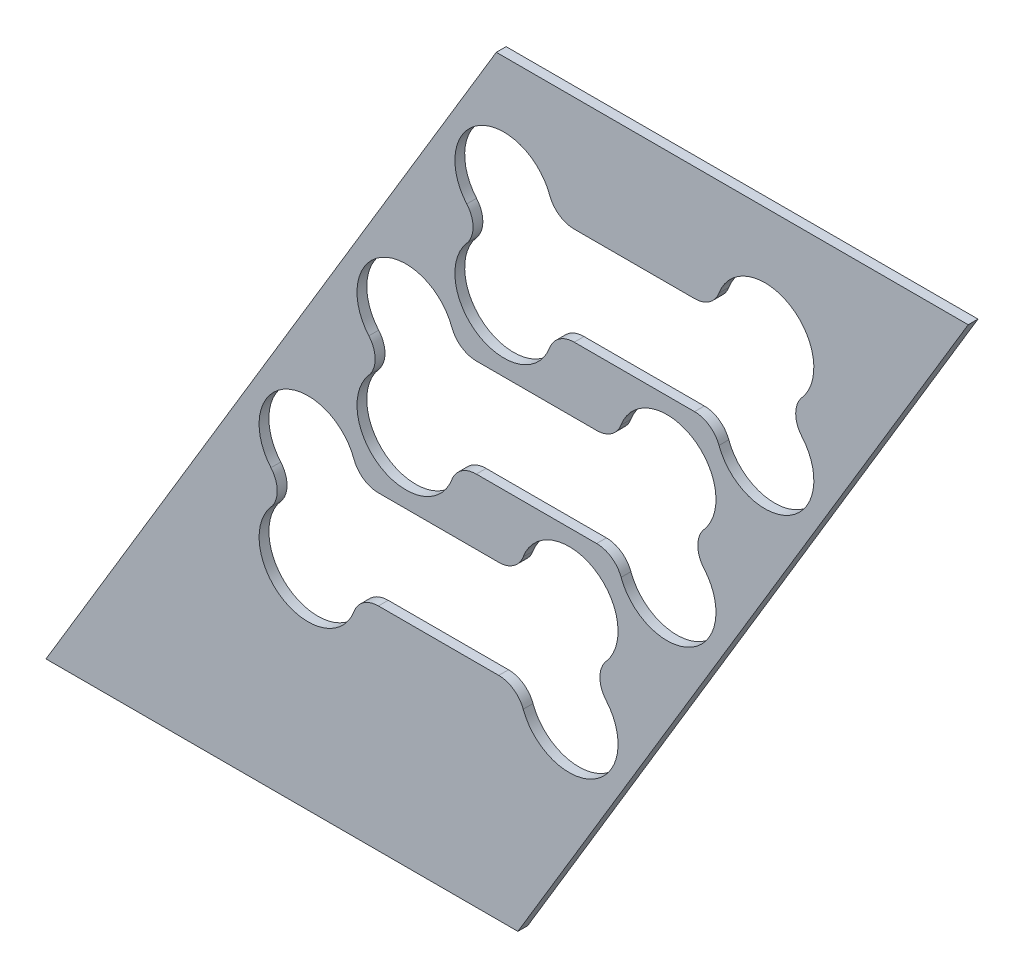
ISO-10303-21;
HEADER;
FILE_DESCRIPTION(('STEP AP214'),'2;1');
FILE_NAME('part.step','',(''),(''),'','','');
FILE_SCHEMA(('AUTOMOTIVE_DESIGN { 1 0 10303 214 1 1 1 1 }'));
ENDSEC;
DATA;
#1=APPLICATION_CONTEXT('core data for automotive mechanical design processes');
#2=APPLICATION_PROTOCOL_DEFINITION('international standard','automotive_design',2000,#1);
#3=PRODUCT_CONTEXT('',#1,'mechanical');
#4=PRODUCT('Part','Part','',(#3));
#5=PRODUCT_RELATED_PRODUCT_CATEGORY('part','',(#4));
#6=PRODUCT_DEFINITION_FORMATION('','',#4);
#7=PRODUCT_DEFINITION_CONTEXT('part definition',#1,'design');
#8=PRODUCT_DEFINITION('design','',#6,#7);
#9=PRODUCT_DEFINITION_SHAPE('','',#8);
#10=(LENGTH_UNIT() NAMED_UNIT(*) SI_UNIT(.MILLI.,.METRE.));
#11=(NAMED_UNIT(*) PLANE_ANGLE_UNIT() SI_UNIT($,.RADIAN.));
#12=(NAMED_UNIT(*) SI_UNIT($,.STERADIAN.) SOLID_ANGLE_UNIT());
#13=UNCERTAINTY_MEASURE_WITH_UNIT(LENGTH_MEASURE(1.E-05),#10,'distance_accuracy_value','');
#14=(GEOMETRIC_REPRESENTATION_CONTEXT(3) GLOBAL_UNCERTAINTY_ASSIGNED_CONTEXT((#13)) GLOBAL_UNIT_ASSIGNED_CONTEXT((#10,
#11,#12)) REPRESENTATION_CONTEXT('',''));
#15=CARTESIAN_POINT('',(0.,0.,0.));
#16=DIRECTION('',(0.,0.,1.));
#17=DIRECTION('',(1.,0.,0.));
#18=AXIS2_PLACEMENT_3D('',#15,#16,#17);
#19=CARTESIAN_POINT('',(81.1519017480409,75.,1.5));
#20=DIRECTION('',(0.,0.,-1.));
#21=DIRECTION('',(-1.,0.,0.));
#22=AXIS2_PLACEMENT_3D('',#19,#20,#21);
#23=PLANE('',#22);
#24=CARTESIAN_POINT('',(24.2180706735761,36.5,1.5));
#25=DIRECTION('',(0.,0.,-1.));
#26=DIRECTION('',(1.,0.,0.));
#27=AXIS2_PLACEMENT_3D('',#24,#25,#26);
#28=CIRCLE('',#27,3.99999999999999);
#29=CARTESIAN_POINT('',(27.9683069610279,35.1086956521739,1.5));
#30=VERTEX_POINT('',#29);
#31=CARTESIAN_POINT('',(24.2180706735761,32.5,1.5));
#32=VERTEX_POINT('',#31);
#33=EDGE_CURVE('E387',#30,#32,#28,.T.);
#34=ORIENTED_EDGE('',*,*,#33,.F.);
#35=CARTESIAN_POINT('',(35.,32.5,1.5));
#36=DIRECTION('',(0.,0.,1.));
#37=DIRECTION('',(1.,0.,0.));
#38=AXIS2_PLACEMENT_3D('',#35,#36,#37);
#39=CIRCLE('',#38,7.5);
#40=CARTESIAN_POINT('',(40.68552036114,27.6086956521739,1.5));
#41=VERTEX_POINT('',#40);
#42=EDGE_CURVE('E411',#41,#30,#39,.T.);
#43=ORIENTED_EDGE('',*,*,#42,.F.);
#44=CARTESIAN_POINT('',(43.7177978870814,25.,1.5));
#45=DIRECTION('',(0.,0.,-1.));
#46=DIRECTION('',(1.,0.,0.));
#47=AXIS2_PLACEMENT_3D('',#44,#45,#46);
#48=CIRCLE('',#47,4.);
#49=CARTESIAN_POINT('',(40.68552036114,22.3913043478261,1.5));
#50=VERTEX_POINT('',#49);
#51=EDGE_CURVE('E408',#50,#41,#48,.T.);
#52=ORIENTED_EDGE('',*,*,#51,.F.);
#53=CARTESIAN_POINT('',(35.,17.5,1.5));
#54=DIRECTION('',(0.,0.,1.));
#55=DIRECTION('',(1.,0.,0.));
#56=AXIS2_PLACEMENT_3D('',#53,#54,#55);
#57=CIRCLE('',#56,7.5);
#58=CARTESIAN_POINT('',(27.9683069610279,14.8913043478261,1.5));
#59=VERTEX_POINT('',#58);
#60=EDGE_CURVE('E406',#59,#50,#57,.T.);
#61=ORIENTED_EDGE('',*,*,#60,.F.);
#62=CARTESIAN_POINT('',(24.2180706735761,13.5,1.5));
#63=DIRECTION('',(0.,0.,-1.));
#64=DIRECTION('',(1.,0.,0.));
#65=AXIS2_PLACEMENT_3D('',#62,#63,#64);
#66=CIRCLE('',#65,4.);
#67=CARTESIAN_POINT('',(24.2180706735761,17.5,1.5));
#68=VERTEX_POINT('',#67);
#69=EDGE_CURVE('E404',#68,#59,#66,.T.);
#70=ORIENTED_EDGE('',*,*,#69,.F.);
#71=DIRECTION('',(1.,0.,0.));
#72=VECTOR('',#71,1.);
#73=CARTESIAN_POINT('',(5.78192932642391,17.5,1.5));
#74=LINE('',#73,#72);
#75=CARTESIAN_POINT('',(5.78192932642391,17.5,1.5));
#76=VERTEX_POINT('',#75);
#77=EDGE_CURVE('E402',#76,#68,#74,.T.);
#78=ORIENTED_EDGE('',*,*,#77,.F.);
#79=CARTESIAN_POINT('',(5.78192932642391,13.5,1.5));
#80=DIRECTION('',(0.,0.,-1.));
#81=DIRECTION('',(1.,0.,0.));
#82=AXIS2_PLACEMENT_3D('',#79,#80,#81);
#83=CIRCLE('',#82,4.);
#84=CARTESIAN_POINT('',(2.03169303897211,14.8913043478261,1.5));
#85=VERTEX_POINT('',#84);
#86=EDGE_CURVE('E400',#85,#76,#83,.T.);
#87=ORIENTED_EDGE('',*,*,#86,.F.);
#88=CARTESIAN_POINT('',(-5.,17.5,1.5));
#89=DIRECTION('',(0.,0.,1.));
#90=DIRECTION('',(1.,0.,0.));
#91=AXIS2_PLACEMENT_3D('',#88,#89,#90);
#92=CIRCLE('',#91,7.5);
#93=CARTESIAN_POINT('',(-10.68552036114,22.3913043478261,1.5));
#94=VERTEX_POINT('',#93);
#95=EDGE_CURVE('E398',#94,#85,#92,.T.);
#96=ORIENTED_EDGE('',*,*,#95,.F.);
#97=CARTESIAN_POINT('',(-13.7177978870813,25.,1.5));
#98=DIRECTION('',(0.,0.,-1.));
#99=DIRECTION('',(1.,0.,0.));
#100=AXIS2_PLACEMENT_3D('',#97,#98,#99);
#101=CIRCLE('',#100,4.);
#102=CARTESIAN_POINT('',(-10.68552036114,27.6086956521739,1.5));
#103=VERTEX_POINT('',#102);
#104=EDGE_CURVE('E396',#103,#94,#101,.T.);
#105=ORIENTED_EDGE('',*,*,#104,.F.);
#106=CARTESIAN_POINT('',(-5.,32.5,1.5));
#107=DIRECTION('',(0.,0.,1.));
#108=DIRECTION('',(1.,0.,0.));
#109=AXIS2_PLACEMENT_3D('',#106,#107,#108);
#110=CIRCLE('',#109,7.5);
#111=CARTESIAN_POINT('',(2.03169303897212,35.1086956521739,1.5));
#112=VERTEX_POINT('',#111);
#113=EDGE_CURVE('E394',#112,#103,#110,.T.);
#114=ORIENTED_EDGE('',*,*,#113,.F.);
#115=CARTESIAN_POINT('',(5.78192932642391,36.5,1.5));
#116=DIRECTION('',(0.,0.,-1.));
#117=DIRECTION('',(1.,0.,0.));
#118=AXIS2_PLACEMENT_3D('',#115,#116,#117);
#119=CIRCLE('',#118,4.);
#120=CARTESIAN_POINT('',(5.78192932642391,32.5,1.5));
#121=VERTEX_POINT('',#120);
#122=EDGE_CURVE('E392',#121,#112,#119,.T.);
#123=ORIENTED_EDGE('',*,*,#122,.F.);
#124=DIRECTION('',(-1.,0.,0.));
#125=VECTOR('',#124,1.);
#126=CARTESIAN_POINT('',(24.2180706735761,32.5,1.5));
#127=LINE('',#126,#125);
#128=EDGE_CURVE('E389',#32,#121,#127,.T.);
#129=ORIENTED_EDGE('',*,*,#128,.F.);
#130=EDGE_LOOP('',(#34,#43,#52,#61,#70,#78,#87,#96,#105,#114,#123,#129));
#131=FACE_BOUND('',#130,.T.);
#132=DIRECTION('',(-1.,0.,0.));
#133=VECTOR('',#132,1.);
#134=CARTESIAN_POINT('',(8.84809825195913,75.,1.5));
#135=LINE('',#134,#133);
#136=CARTESIAN_POINT('',(81.1519017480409,75.,1.5));
#137=VERTEX_POINT('',#136);
#138=CARTESIAN_POINT('',(8.84809825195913,75.,1.5));
#139=VERTEX_POINT('',#138);
#140=EDGE_CURVE('E561',#137,#139,#135,.T.);
#141=ORIENTED_EDGE('',*,*,#140,.T.);
#142=DIRECTION('',(-0.514495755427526,-0.857492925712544,0.));
#143=VECTOR('',#142,1.);
#144=CARTESIAN_POINT('',(8.84809825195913,75.,1.5));
#145=LINE('',#144,#143);
#146=CARTESIAN_POINT('',(-60.1519017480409,-40.,1.5));
#147=VERTEX_POINT('',#146);
#148=EDGE_CURVE('E564',#139,#147,#145,.T.);
#149=ORIENTED_EDGE('',*,*,#148,.T.);
#150=DIRECTION('',(1.,0.,0.));
#151=VECTOR('',#150,1.);
#152=CARTESIAN_POINT('',(-60.1519017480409,-40.,1.5));
#153=LINE('',#152,#151);
#154=CARTESIAN_POINT('',(12.1519017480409,-40.,1.5));
#155=VERTEX_POINT('',#154);
#156=EDGE_CURVE('E567',#147,#155,#153,.T.);
#157=ORIENTED_EDGE('',*,*,#156,.T.);
#158=DIRECTION('',(0.514495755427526,0.857492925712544,0.));
#159=VECTOR('',#158,1.);
#160=CARTESIAN_POINT('',(81.1519017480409,75.,1.5));
#161=LINE('',#160,#159);
#162=EDGE_CURVE('E569',#155,#137,#161,.T.);
#163=ORIENTED_EDGE('',*,*,#162,.T.);
#164=EDGE_LOOP('',(#141,#149,#157,#163));
#165=FACE_BOUND('',#164,.T.);
#166=CARTESIAN_POINT('',(9.2180706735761,11.5,1.5));
#167=DIRECTION('',(0.,0.,-1.));
#168=DIRECTION('',(1.,0.,0.));
#169=AXIS2_PLACEMENT_3D('',#166,#167,#168);
#170=CIRCLE('',#169,4.);
#171=CARTESIAN_POINT('',(12.9683069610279,10.1086956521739,1.5));
#172=VERTEX_POINT('',#171);
#173=CARTESIAN_POINT('',(9.2180706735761,7.50000000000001,1.5));
#174=VERTEX_POINT('',#173);
#175=EDGE_CURVE('E474',#172,#174,#170,.T.);
#176=ORIENTED_EDGE('',*,*,#175,.F.);
#177=CARTESIAN_POINT('',(20.,7.50000000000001,1.5));
#178=DIRECTION('',(0.,0.,1.));
#179=DIRECTION('',(1.,0.,0.));
#180=AXIS2_PLACEMENT_3D('',#177,#178,#179);
#181=CIRCLE('',#180,7.5);
#182=CARTESIAN_POINT('',(25.68552036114,2.60869565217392,1.5));
#183=VERTEX_POINT('',#182);
#184=EDGE_CURVE('E498',#183,#172,#181,.T.);
#185=ORIENTED_EDGE('',*,*,#184,.F.);
#186=CARTESIAN_POINT('',(28.7177978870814,0.,1.5));
#187=DIRECTION('',(0.,0.,-1.));
#188=DIRECTION('',(1.,0.,0.));
#189=AXIS2_PLACEMENT_3D('',#186,#187,#188);
#190=CIRCLE('',#189,4.);
#191=CARTESIAN_POINT('',(25.68552036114,-2.60869565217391,1.5));
#192=VERTEX_POINT('',#191);
#193=EDGE_CURVE('E495',#192,#183,#190,.T.);
#194=ORIENTED_EDGE('',*,*,#193,.F.);
#195=CARTESIAN_POINT('',(20.,-7.49999999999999,1.5));
#196=DIRECTION('',(0.,0.,1.));
#197=DIRECTION('',(1.,0.,0.));
#198=AXIS2_PLACEMENT_3D('',#195,#196,#197);
#199=CIRCLE('',#198,7.5);
#200=CARTESIAN_POINT('',(12.9683069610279,-10.1086956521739,1.5));
#201=VERTEX_POINT('',#200);
#202=EDGE_CURVE('E493',#201,#192,#199,.T.);
#203=ORIENTED_EDGE('',*,*,#202,.F.);
#204=CARTESIAN_POINT('',(9.2180706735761,-11.5,1.5));
#205=DIRECTION('',(0.,0.,-1.));
#206=DIRECTION('',(1.,0.,0.));
#207=AXIS2_PLACEMENT_3D('',#204,#205,#206);
#208=CIRCLE('',#207,4.);
#209=CARTESIAN_POINT('',(9.2180706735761,-7.5,1.5));
#210=VERTEX_POINT('',#209);
#211=EDGE_CURVE('E491',#210,#201,#208,.T.);
#212=ORIENTED_EDGE('',*,*,#211,.F.);
#213=DIRECTION('',(1.,0.,0.));
#214=VECTOR('',#213,1.);
#215=CARTESIAN_POINT('',(-9.21807067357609,-7.5,1.5));
#216=LINE('',#215,#214);
#217=CARTESIAN_POINT('',(-9.21807067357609,-7.5,1.5));
#218=VERTEX_POINT('',#217);
#219=EDGE_CURVE('E489',#218,#210,#216,.T.);
#220=ORIENTED_EDGE('',*,*,#219,.F.);
#221=CARTESIAN_POINT('',(-9.21807067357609,-11.5,1.5));
#222=DIRECTION('',(0.,0.,-1.));
#223=DIRECTION('',(1.,0.,0.));
#224=AXIS2_PLACEMENT_3D('',#221,#222,#223);
#225=CIRCLE('',#224,4.);
#226=CARTESIAN_POINT('',(-12.9683069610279,-10.1086956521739,1.5));
#227=VERTEX_POINT('',#226);
#228=EDGE_CURVE('E487',#227,#218,#225,.T.);
#229=ORIENTED_EDGE('',*,*,#228,.F.);
#230=CARTESIAN_POINT('',(-20.,-7.5,1.5));
#231=DIRECTION('',(0.,0.,1.));
#232=DIRECTION('',(1.,0.,0.));
#233=AXIS2_PLACEMENT_3D('',#230,#231,#232);
#234=CIRCLE('',#233,7.5);
#235=CARTESIAN_POINT('',(-25.68552036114,-2.60869565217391,1.5));
#236=VERTEX_POINT('',#235);
#237=EDGE_CURVE('E485',#236,#227,#234,.T.);
#238=ORIENTED_EDGE('',*,*,#237,.F.);
#239=CARTESIAN_POINT('',(-28.7177978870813,0.,1.5));
#240=DIRECTION('',(0.,0.,-1.));
#241=DIRECTION('',(1.,0.,0.));
#242=AXIS2_PLACEMENT_3D('',#239,#240,#241);
#243=CIRCLE('',#242,4.);
#244=CARTESIAN_POINT('',(-25.68552036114,2.60869565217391,1.5));
#245=VERTEX_POINT('',#244);
#246=EDGE_CURVE('E483',#245,#236,#243,.T.);
#247=ORIENTED_EDGE('',*,*,#246,.F.);
#248=CARTESIAN_POINT('',(-20.,7.5,1.5));
#249=DIRECTION('',(0.,0.,1.));
#250=DIRECTION('',(1.,0.,0.));
#251=AXIS2_PLACEMENT_3D('',#248,#249,#250);
#252=CIRCLE('',#251,7.5);
#253=CARTESIAN_POINT('',(-12.9683069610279,10.1086956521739,1.5));
#254=VERTEX_POINT('',#253);
#255=EDGE_CURVE('E481',#254,#245,#252,.T.);
#256=ORIENTED_EDGE('',*,*,#255,.F.);
#257=CARTESIAN_POINT('',(-9.21807067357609,11.5,1.5));
#258=DIRECTION('',(0.,0.,-1.));
#259=DIRECTION('',(1.,0.,0.));
#260=AXIS2_PLACEMENT_3D('',#257,#258,#259);
#261=CIRCLE('',#260,4.);
#262=CARTESIAN_POINT('',(-9.21807067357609,7.5,1.5));
#263=VERTEX_POINT('',#262);
#264=EDGE_CURVE('E479',#263,#254,#261,.T.);
#265=ORIENTED_EDGE('',*,*,#264,.F.);
#266=DIRECTION('',(-1.,0.,0.));
#267=VECTOR('',#266,1.);
#268=CARTESIAN_POINT('',(9.2180706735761,7.50000000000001,1.5));
#269=LINE('',#268,#267);
#270=EDGE_CURVE('E476',#174,#263,#269,.T.);
#271=ORIENTED_EDGE('',*,*,#270,.F.);
#272=EDGE_LOOP('',(#176,#185,#194,#203,#212,#220,#229,#238,#247,#256,#265,#271));
#273=FACE_BOUND('',#272,.T.);
#274=CARTESIAN_POINT('',(39.2180706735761,61.5,1.5));
#275=DIRECTION('',(0.,0.,-1.));
#276=DIRECTION('',(1.,0.,0.));
#277=AXIS2_PLACEMENT_3D('',#274,#275,#276);
#278=CIRCLE('',#277,3.99999999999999);
#279=CARTESIAN_POINT('',(42.9683069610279,60.1086956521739,1.5));
#280=VERTEX_POINT('',#279);
#281=CARTESIAN_POINT('',(39.2180706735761,57.5,1.5));
#282=VERTEX_POINT('',#281);
#283=EDGE_CURVE('E294',#280,#282,#278,.T.);
#284=ORIENTED_EDGE('',*,*,#283,.F.);
#285=CARTESIAN_POINT('',(50.,57.5,1.5));
#286=DIRECTION('',(0.,0.,1.));
#287=DIRECTION('',(1.,0.,0.));
#288=AXIS2_PLACEMENT_3D('',#285,#286,#287);
#289=CIRCLE('',#288,7.5);
#290=CARTESIAN_POINT('',(55.68552036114,52.6086956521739,1.5));
#291=VERTEX_POINT('',#290);
#292=EDGE_CURVE('E335',#291,#280,#289,.T.);
#293=ORIENTED_EDGE('',*,*,#292,.F.);
#294=CARTESIAN_POINT('',(58.7177978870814,50.,1.5));
#295=DIRECTION('',(0.,0.,-1.));
#296=DIRECTION('',(1.,0.,0.));
#297=AXIS2_PLACEMENT_3D('',#294,#295,#296);
#298=CIRCLE('',#297,3.99999999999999);
#299=CARTESIAN_POINT('',(55.68552036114,47.3913043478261,1.5));
#300=VERTEX_POINT('',#299);
#301=EDGE_CURVE('E333',#300,#291,#298,.T.);
#302=ORIENTED_EDGE('',*,*,#301,.F.);
#303=CARTESIAN_POINT('',(50.,42.5,1.5));
#304=DIRECTION('',(0.,0.,1.));
#305=DIRECTION('',(1.,0.,0.));
#306=AXIS2_PLACEMENT_3D('',#303,#304,#305);
#307=CIRCLE('',#306,7.5);
#308=CARTESIAN_POINT('',(42.9683069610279,39.8913043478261,1.5));
#309=VERTEX_POINT('',#308);
#310=EDGE_CURVE('E331',#309,#300,#307,.T.);
#311=ORIENTED_EDGE('',*,*,#310,.F.);
#312=CARTESIAN_POINT('',(39.2180706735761,38.5,1.5));
#313=DIRECTION('',(0.,0.,-1.));
#314=DIRECTION('',(1.,0.,0.));
#315=AXIS2_PLACEMENT_3D('',#312,#313,#314);
#316=CIRCLE('',#315,4.);
#317=CARTESIAN_POINT('',(39.2180706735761,42.5,1.5));
#318=VERTEX_POINT('',#317);
#319=EDGE_CURVE('E329',#318,#309,#316,.T.);
#320=ORIENTED_EDGE('',*,*,#319,.F.);
#321=DIRECTION('',(1.,0.,0.));
#322=VECTOR('',#321,1.);
#323=CARTESIAN_POINT('',(20.7819293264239,42.5,1.5));
#324=LINE('',#323,#322);
#325=CARTESIAN_POINT('',(20.7819293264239,42.5,1.5));
#326=VERTEX_POINT('',#325);
#327=EDGE_CURVE('E327',#326,#318,#324,.T.);
#328=ORIENTED_EDGE('',*,*,#327,.F.);
#329=CARTESIAN_POINT('',(20.7819293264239,38.5,1.5));
#330=DIRECTION('',(0.,0.,-1.));
#331=DIRECTION('',(1.,0.,0.));
#332=AXIS2_PLACEMENT_3D('',#329,#330,#331);
#333=CIRCLE('',#332,4.);
#334=CARTESIAN_POINT('',(17.0316930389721,39.8913043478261,1.5));
#335=VERTEX_POINT('',#334);
#336=EDGE_CURVE('E325',#335,#326,#333,.T.);
#337=ORIENTED_EDGE('',*,*,#336,.F.);
#338=CARTESIAN_POINT('',(10.,42.5,1.5));
#339=DIRECTION('',(0.,0.,1.));
#340=DIRECTION('',(1.,0.,0.));
#341=AXIS2_PLACEMENT_3D('',#338,#339,#340);
#342=CIRCLE('',#341,7.5);
#343=CARTESIAN_POINT('',(4.31447963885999,47.3913043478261,1.5));
#344=VERTEX_POINT('',#343);
#345=EDGE_CURVE('E323',#344,#335,#342,.T.);
#346=ORIENTED_EDGE('',*,*,#345,.F.);
#347=CARTESIAN_POINT('',(1.28220211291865,50.,1.5));
#348=DIRECTION('',(0.,0.,-1.));
#349=DIRECTION('',(1.,0.,0.));
#350=AXIS2_PLACEMENT_3D('',#347,#348,#349);
#351=CIRCLE('',#350,4.);
#352=CARTESIAN_POINT('',(4.31447963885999,52.6086956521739,1.5));
#353=VERTEX_POINT('',#352);
#354=EDGE_CURVE('E321',#353,#344,#351,.T.);
#355=ORIENTED_EDGE('',*,*,#354,.F.);
#356=CARTESIAN_POINT('',(10.,57.5,1.5));
#357=DIRECTION('',(0.,0.,1.));
#358=DIRECTION('',(1.,0.,0.));
#359=AXIS2_PLACEMENT_3D('',#356,#357,#358);
#360=CIRCLE('',#359,7.5);
#361=CARTESIAN_POINT('',(17.0316930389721,60.1086956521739,1.5));
#362=VERTEX_POINT('',#361);
#363=EDGE_CURVE('E317',#362,#353,#360,.T.);
#364=ORIENTED_EDGE('',*,*,#363,.F.);
#365=CARTESIAN_POINT('',(20.7819293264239,61.5,1.5));
#366=DIRECTION('',(0.,0.,-1.));
#367=DIRECTION('',(1.,0.,0.));
#368=AXIS2_PLACEMENT_3D('',#365,#366,#367);
#369=CIRCLE('',#368,4.);
#370=CARTESIAN_POINT('',(20.7819293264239,57.5,1.5));
#371=VERTEX_POINT('',#370);
#372=EDGE_CURVE('E315',#371,#362,#369,.T.);
#373=ORIENTED_EDGE('',*,*,#372,.F.);
#374=DIRECTION('',(-1.,0.,0.));
#375=VECTOR('',#374,1.);
#376=CARTESIAN_POINT('',(39.2180706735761,57.5,1.5));
#377=LINE('',#376,#375);
#378=EDGE_CURVE('E302',#282,#371,#377,.T.);
#379=ORIENTED_EDGE('',*,*,#378,.F.);
#380=EDGE_LOOP('',(#284,#293,#302,#311,#320,#328,#337,#346,#355,#364,#373,#379));
#381=FACE_BOUND('',#380,.T.);
#382=ADVANCED_FACE('F37',(#131,#165,#273,#381),#23,.F.);
#383=CARTESIAN_POINT('',(81.1519017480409,75.,0.));
#384=DIRECTION('',(0.,0.,-1.));
#385=DIRECTION('',(-1.,0.,0.));
#386=AXIS2_PLACEMENT_3D('',#383,#384,#385);
#387=PLANE('',#386);
#388=CARTESIAN_POINT('',(35.,32.5,0.));
#389=DIRECTION('',(0.,0.,1.));
#390=DIRECTION('',(1.,0.,0.));
#391=AXIS2_PLACEMENT_3D('',#388,#389,#390);
#392=CIRCLE('',#391,7.5);
#393=CARTESIAN_POINT('',(40.68552036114,27.6086956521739,0.));
#394=VERTEX_POINT('',#393);
#395=CARTESIAN_POINT('',(27.9683069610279,35.1086956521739,0.));
#396=VERTEX_POINT('',#395);
#397=EDGE_CURVE('E390',#394,#396,#392,.T.);
#398=ORIENTED_EDGE('',*,*,#397,.T.);
#399=CARTESIAN_POINT('',(24.2180706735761,36.5,0.));
#400=DIRECTION('',(0.,0.,-1.));
#401=DIRECTION('',(1.,0.,0.));
#402=AXIS2_PLACEMENT_3D('',#399,#400,#401);
#403=CIRCLE('',#402,3.99999999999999);
#404=CARTESIAN_POINT('',(24.2180706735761,32.5,0.));
#405=VERTEX_POINT('',#404);
#406=EDGE_CURVE('E310',#396,#405,#403,.T.);
#407=ORIENTED_EDGE('',*,*,#406,.T.);
#408=DIRECTION('',(-1.,0.,0.));
#409=VECTOR('',#408,1.);
#410=CARTESIAN_POINT('',(24.2180706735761,32.5,0.));
#411=LINE('',#410,#409);
#412=CARTESIAN_POINT('',(5.78192932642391,32.5,0.));
#413=VERTEX_POINT('',#412);
#414=EDGE_CURVE('E416',#405,#413,#411,.T.);
#415=ORIENTED_EDGE('',*,*,#414,.T.);
#416=CARTESIAN_POINT('',(5.78192932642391,36.5,0.));
#417=DIRECTION('',(0.,0.,-1.));
#418=DIRECTION('',(1.,0.,0.));
#419=AXIS2_PLACEMENT_3D('',#416,#417,#418);
#420=CIRCLE('',#419,4.);
#421=CARTESIAN_POINT('',(2.03169303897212,35.1086956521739,0.));
#422=VERTEX_POINT('',#421);
#423=EDGE_CURVE('E419',#413,#422,#420,.T.);
#424=ORIENTED_EDGE('',*,*,#423,.T.);
#425=CARTESIAN_POINT('',(-5.,32.5,0.));
#426=DIRECTION('',(0.,0.,1.));
#427=DIRECTION('',(1.,0.,0.));
#428=AXIS2_PLACEMENT_3D('',#425,#426,#427);
#429=CIRCLE('',#428,7.5);
#430=CARTESIAN_POINT('',(-10.68552036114,27.6086956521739,0.));
#431=VERTEX_POINT('',#430);
#432=EDGE_CURVE('E422',#422,#431,#429,.T.);
#433=ORIENTED_EDGE('',*,*,#432,.T.);
#434=CARTESIAN_POINT('',(-13.7177978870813,25.,0.));
#435=DIRECTION('',(0.,0.,-1.));
#436=DIRECTION('',(1.,0.,0.));
#437=AXIS2_PLACEMENT_3D('',#434,#435,#436);
#438=CIRCLE('',#437,4.);
#439=CARTESIAN_POINT('',(-10.68552036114,22.3913043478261,0.));
#440=VERTEX_POINT('',#439);
#441=EDGE_CURVE('E425',#431,#440,#438,.T.);
#442=ORIENTED_EDGE('',*,*,#441,.T.);
#443=CARTESIAN_POINT('',(-5.,17.5,0.));
#444=DIRECTION('',(0.,0.,1.));
#445=DIRECTION('',(1.,0.,0.));
#446=AXIS2_PLACEMENT_3D('',#443,#444,#445);
#447=CIRCLE('',#446,7.5);
#448=CARTESIAN_POINT('',(2.03169303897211,14.8913043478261,0.));
#449=VERTEX_POINT('',#448);
#450=EDGE_CURVE('E428',#440,#449,#447,.T.);
#451=ORIENTED_EDGE('',*,*,#450,.T.);
#452=CARTESIAN_POINT('',(5.78192932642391,13.5,0.));
#453=DIRECTION('',(0.,0.,-1.));
#454=DIRECTION('',(1.,0.,0.));
#455=AXIS2_PLACEMENT_3D('',#452,#453,#454);
#456=CIRCLE('',#455,4.);
#457=CARTESIAN_POINT('',(5.78192932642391,17.5,0.));
#458=VERTEX_POINT('',#457);
#459=EDGE_CURVE('E431',#449,#458,#456,.T.);
#460=ORIENTED_EDGE('',*,*,#459,.T.);
#461=DIRECTION('',(1.,0.,0.));
#462=VECTOR('',#461,1.);
#463=CARTESIAN_POINT('',(5.78192932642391,17.5,0.));
#464=LINE('',#463,#462);
#465=CARTESIAN_POINT('',(24.2180706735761,17.5,0.));
#466=VERTEX_POINT('',#465);
#467=EDGE_CURVE('E434',#458,#466,#464,.T.);
#468=ORIENTED_EDGE('',*,*,#467,.T.);
#469=CARTESIAN_POINT('',(24.2180706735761,13.5,0.));
#470=DIRECTION('',(0.,0.,-1.));
#471=DIRECTION('',(1.,0.,0.));
#472=AXIS2_PLACEMENT_3D('',#469,#470,#471);
#473=CIRCLE('',#472,4.);
#474=CARTESIAN_POINT('',(27.9683069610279,14.8913043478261,0.));
#475=VERTEX_POINT('',#474);
#476=EDGE_CURVE('E437',#466,#475,#473,.T.);
#477=ORIENTED_EDGE('',*,*,#476,.T.);
#478=CARTESIAN_POINT('',(35.,17.5,0.));
#479=DIRECTION('',(0.,0.,1.));
#480=DIRECTION('',(1.,0.,0.));
#481=AXIS2_PLACEMENT_3D('',#478,#479,#480);
#482=CIRCLE('',#481,7.5);
#483=CARTESIAN_POINT('',(40.68552036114,22.3913043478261,0.));
#484=VERTEX_POINT('',#483);
#485=EDGE_CURVE('E440',#475,#484,#482,.T.);
#486=ORIENTED_EDGE('',*,*,#485,.T.);
#487=CARTESIAN_POINT('',(43.7177978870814,25.,0.));
#488=DIRECTION('',(0.,0.,-1.));
#489=DIRECTION('',(1.,0.,0.));
#490=AXIS2_PLACEMENT_3D('',#487,#488,#489);
#491=CIRCLE('',#490,4.);
#492=EDGE_CURVE('E443',#484,#394,#491,.T.);
#493=ORIENTED_EDGE('',*,*,#492,.T.);
#494=EDGE_LOOP('',(#398,#407,#415,#424,#433,#442,#451,#460,#468,#477,#486,#493));
#495=FACE_BOUND('',#494,.T.);
#496=DIRECTION('',(-1.,0.,0.));
#497=VECTOR('',#496,1.);
#498=CARTESIAN_POINT('',(8.84809825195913,75.,0.));
#499=LINE('',#498,#497);
#500=CARTESIAN_POINT('',(81.1519017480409,75.,0.));
#501=VERTEX_POINT('',#500);
#502=CARTESIAN_POINT('',(8.84809825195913,75.,0.));
#503=VERTEX_POINT('',#502);
#504=EDGE_CURVE('E560',#501,#503,#499,.T.);
#505=ORIENTED_EDGE('',*,*,#504,.F.);
#506=DIRECTION('',(0.514495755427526,0.857492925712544,0.));
#507=VECTOR('',#506,1.);
#508=CARTESIAN_POINT('',(81.1519017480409,75.,0.));
#509=LINE('',#508,#507);
#510=CARTESIAN_POINT('',(12.1519017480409,-40.,0.));
#511=VERTEX_POINT('',#510);
#512=EDGE_CURVE('E565',#511,#501,#509,.T.);
#513=ORIENTED_EDGE('',*,*,#512,.F.);
#514=DIRECTION('',(1.,0.,0.));
#515=VECTOR('',#514,1.);
#516=CARTESIAN_POINT('',(-60.1519017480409,-40.,0.));
#517=LINE('',#516,#515);
#518=CARTESIAN_POINT('',(-60.1519017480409,-40.,0.));
#519=VERTEX_POINT('',#518);
#520=EDGE_CURVE('E576',#519,#511,#517,.T.);
#521=ORIENTED_EDGE('',*,*,#520,.F.);
#522=DIRECTION('',(-0.514495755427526,-0.857492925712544,0.));
#523=VECTOR('',#522,1.);
#524=CARTESIAN_POINT('',(8.84809825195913,75.,0.));
#525=LINE('',#524,#523);
#526=EDGE_CURVE('E574',#503,#519,#525,.T.);
#527=ORIENTED_EDGE('',*,*,#526,.F.);
#528=EDGE_LOOP('',(#505,#513,#521,#527));
#529=FACE_BOUND('',#528,.T.);
#530=CARTESIAN_POINT('',(20.,7.50000000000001,0.));
#531=DIRECTION('',(0.,0.,1.));
#532=DIRECTION('',(1.,0.,0.));
#533=AXIS2_PLACEMENT_3D('',#530,#531,#532);
#534=CIRCLE('',#533,7.5);
#535=CARTESIAN_POINT('',(25.68552036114,2.60869565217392,0.));
#536=VERTEX_POINT('',#535);
#537=CARTESIAN_POINT('',(12.9683069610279,10.1086956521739,0.));
#538=VERTEX_POINT('',#537);
#539=EDGE_CURVE('E477',#536,#538,#534,.T.);
#540=ORIENTED_EDGE('',*,*,#539,.T.);
#541=CARTESIAN_POINT('',(9.2180706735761,11.5,0.));
#542=DIRECTION('',(0.,0.,-1.));
#543=DIRECTION('',(1.,0.,0.));
#544=AXIS2_PLACEMENT_3D('',#541,#542,#543);
#545=CIRCLE('',#544,4.);
#546=CARTESIAN_POINT('',(9.2180706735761,7.50000000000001,0.));
#547=VERTEX_POINT('',#546);
#548=EDGE_CURVE('E473',#538,#547,#545,.T.);
#549=ORIENTED_EDGE('',*,*,#548,.T.);
#550=DIRECTION('',(-1.,0.,0.));
#551=VECTOR('',#550,1.);
#552=CARTESIAN_POINT('',(9.2180706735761,7.50000000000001,0.));
#553=LINE('',#552,#551);
#554=CARTESIAN_POINT('',(-9.21807067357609,7.5,0.));
#555=VERTEX_POINT('',#554);
#556=EDGE_CURVE('E503',#547,#555,#553,.T.);
#557=ORIENTED_EDGE('',*,*,#556,.T.);
#558=CARTESIAN_POINT('',(-9.21807067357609,11.5,0.));
#559=DIRECTION('',(0.,0.,-1.));
#560=DIRECTION('',(1.,0.,0.));
#561=AXIS2_PLACEMENT_3D('',#558,#559,#560);
#562=CIRCLE('',#561,4.);
#563=CARTESIAN_POINT('',(-12.9683069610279,10.1086956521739,0.));
#564=VERTEX_POINT('',#563);
#565=EDGE_CURVE('E506',#555,#564,#562,.T.);
#566=ORIENTED_EDGE('',*,*,#565,.T.);
#567=CARTESIAN_POINT('',(-20.,7.5,0.));
#568=DIRECTION('',(0.,0.,1.));
#569=DIRECTION('',(1.,0.,0.));
#570=AXIS2_PLACEMENT_3D('',#567,#568,#569);
#571=CIRCLE('',#570,7.5);
#572=CARTESIAN_POINT('',(-25.68552036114,2.60869565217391,0.));
#573=VERTEX_POINT('',#572);
#574=EDGE_CURVE('E509',#564,#573,#571,.T.);
#575=ORIENTED_EDGE('',*,*,#574,.T.);
#576=CARTESIAN_POINT('',(-28.7177978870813,0.,0.));
#577=DIRECTION('',(0.,0.,-1.));
#578=DIRECTION('',(1.,0.,0.));
#579=AXIS2_PLACEMENT_3D('',#576,#577,#578);
#580=CIRCLE('',#579,4.);
#581=CARTESIAN_POINT('',(-25.68552036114,-2.60869565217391,0.));
#582=VERTEX_POINT('',#581);
#583=EDGE_CURVE('E512',#573,#582,#580,.T.);
#584=ORIENTED_EDGE('',*,*,#583,.T.);
#585=CARTESIAN_POINT('',(-20.,-7.5,0.));
#586=DIRECTION('',(0.,0.,1.));
#587=DIRECTION('',(1.,0.,0.));
#588=AXIS2_PLACEMENT_3D('',#585,#586,#587);
#589=CIRCLE('',#588,7.5);
#590=CARTESIAN_POINT('',(-12.9683069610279,-10.1086956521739,0.));
#591=VERTEX_POINT('',#590);
#592=EDGE_CURVE('E515',#582,#591,#589,.T.);
#593=ORIENTED_EDGE('',*,*,#592,.T.);
#594=CARTESIAN_POINT('',(-9.21807067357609,-11.5,0.));
#595=DIRECTION('',(0.,0.,-1.));
#596=DIRECTION('',(1.,0.,0.));
#597=AXIS2_PLACEMENT_3D('',#594,#595,#596);
#598=CIRCLE('',#597,4.);
#599=CARTESIAN_POINT('',(-9.21807067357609,-7.5,0.));
#600=VERTEX_POINT('',#599);
#601=EDGE_CURVE('E518',#591,#600,#598,.T.);
#602=ORIENTED_EDGE('',*,*,#601,.T.);
#603=DIRECTION('',(1.,0.,0.));
#604=VECTOR('',#603,1.);
#605=CARTESIAN_POINT('',(-9.21807067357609,-7.5,0.));
#606=LINE('',#605,#604);
#607=CARTESIAN_POINT('',(9.2180706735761,-7.5,0.));
#608=VERTEX_POINT('',#607);
#609=EDGE_CURVE('E521',#600,#608,#606,.T.);
#610=ORIENTED_EDGE('',*,*,#609,.T.);
#611=CARTESIAN_POINT('',(9.2180706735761,-11.5,0.));
#612=DIRECTION('',(0.,0.,-1.));
#613=DIRECTION('',(1.,0.,0.));
#614=AXIS2_PLACEMENT_3D('',#611,#612,#613);
#615=CIRCLE('',#614,4.);
#616=CARTESIAN_POINT('',(12.9683069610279,-10.1086956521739,0.));
#617=VERTEX_POINT('',#616);
#618=EDGE_CURVE('E524',#608,#617,#615,.T.);
#619=ORIENTED_EDGE('',*,*,#618,.T.);
#620=CARTESIAN_POINT('',(20.,-7.49999999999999,0.));
#621=DIRECTION('',(0.,0.,1.));
#622=DIRECTION('',(1.,0.,0.));
#623=AXIS2_PLACEMENT_3D('',#620,#621,#622);
#624=CIRCLE('',#623,7.5);
#625=CARTESIAN_POINT('',(25.68552036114,-2.60869565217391,0.));
#626=VERTEX_POINT('',#625);
#627=EDGE_CURVE('E527',#617,#626,#624,.T.);
#628=ORIENTED_EDGE('',*,*,#627,.T.);
#629=CARTESIAN_POINT('',(28.7177978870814,0.,0.));
#630=DIRECTION('',(0.,0.,-1.));
#631=DIRECTION('',(1.,0.,0.));
#632=AXIS2_PLACEMENT_3D('',#629,#630,#631);
#633=CIRCLE('',#632,4.);
#634=EDGE_CURVE('E530',#626,#536,#633,.T.);
#635=ORIENTED_EDGE('',*,*,#634,.T.);
#636=EDGE_LOOP('',(#540,#549,#557,#566,#575,#584,#593,#602,#610,#619,#628,#635));
#637=FACE_BOUND('',#636,.T.);
#638=CARTESIAN_POINT('',(50.,57.5,0.));
#639=DIRECTION('',(0.,0.,1.));
#640=DIRECTION('',(1.,0.,0.));
#641=AXIS2_PLACEMENT_3D('',#638,#639,#640);
#642=CIRCLE('',#641,7.5);
#643=CARTESIAN_POINT('',(55.68552036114,52.6086956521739,0.));
#644=VERTEX_POINT('',#643);
#645=CARTESIAN_POINT('',(42.9683069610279,60.1086956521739,0.));
#646=VERTEX_POINT('',#645);
#647=EDGE_CURVE('E303',#644,#646,#642,.T.);
#648=ORIENTED_EDGE('',*,*,#647,.T.);
#649=CARTESIAN_POINT('',(39.2180706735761,61.5,0.));
#650=DIRECTION('',(0.,0.,-1.));
#651=DIRECTION('',(1.,0.,0.));
#652=AXIS2_PLACEMENT_3D('',#649,#650,#651);
#653=CIRCLE('',#652,3.99999999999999);
#654=CARTESIAN_POINT('',(39.2180706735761,57.5,0.));
#655=VERTEX_POINT('',#654);
#656=EDGE_CURVE('E60',#646,#655,#653,.T.);
#657=ORIENTED_EDGE('',*,*,#656,.T.);
#658=DIRECTION('',(-1.,0.,0.));
#659=VECTOR('',#658,1.);
#660=CARTESIAN_POINT('',(39.2180706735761,57.5,0.));
#661=LINE('',#660,#659);
#662=CARTESIAN_POINT('',(20.7819293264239,57.5,0.));
#663=VERTEX_POINT('',#662);
#664=EDGE_CURVE('E309',#655,#663,#661,.T.);
#665=ORIENTED_EDGE('',*,*,#664,.T.);
#666=CARTESIAN_POINT('',(20.7819293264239,61.5,0.));
#667=DIRECTION('',(0.,0.,-1.));
#668=DIRECTION('',(1.,0.,0.));
#669=AXIS2_PLACEMENT_3D('',#666,#667,#668);
#670=CIRCLE('',#669,4.);
#671=CARTESIAN_POINT('',(17.0316930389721,60.1086956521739,0.));
#672=VERTEX_POINT('',#671);
#673=EDGE_CURVE('E339',#663,#672,#670,.T.);
#674=ORIENTED_EDGE('',*,*,#673,.T.);
#675=CARTESIAN_POINT('',(10.,57.5,0.));
#676=DIRECTION('',(0.,0.,1.));
#677=DIRECTION('',(1.,0.,0.));
#678=AXIS2_PLACEMENT_3D('',#675,#676,#677);
#679=CIRCLE('',#678,7.5);
#680=CARTESIAN_POINT('',(4.31447963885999,52.6086956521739,0.));
#681=VERTEX_POINT('',#680);
#682=EDGE_CURVE('E342',#672,#681,#679,.T.);
#683=ORIENTED_EDGE('',*,*,#682,.T.);
#684=CARTESIAN_POINT('',(1.28220211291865,50.,0.));
#685=DIRECTION('',(0.,0.,-1.));
#686=DIRECTION('',(1.,0.,0.));
#687=AXIS2_PLACEMENT_3D('',#684,#685,#686);
#688=CIRCLE('',#687,4.);
#689=CARTESIAN_POINT('',(4.31447963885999,47.3913043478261,0.));
#690=VERTEX_POINT('',#689);
#691=EDGE_CURVE('E345',#681,#690,#688,.T.);
#692=ORIENTED_EDGE('',*,*,#691,.T.);
#693=CARTESIAN_POINT('',(10.,42.5,0.));
#694=DIRECTION('',(0.,0.,1.));
#695=DIRECTION('',(1.,0.,0.));
#696=AXIS2_PLACEMENT_3D('',#693,#694,#695);
#697=CIRCLE('',#696,7.5);
#698=CARTESIAN_POINT('',(17.0316930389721,39.8913043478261,0.));
#699=VERTEX_POINT('',#698);
#700=EDGE_CURVE('E348',#690,#699,#697,.T.);
#701=ORIENTED_EDGE('',*,*,#700,.T.);
#702=CARTESIAN_POINT('',(20.7819293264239,38.5,0.));
#703=DIRECTION('',(0.,0.,-1.));
#704=DIRECTION('',(1.,0.,0.));
#705=AXIS2_PLACEMENT_3D('',#702,#703,#704);
#706=CIRCLE('',#705,4.);
#707=CARTESIAN_POINT('',(20.7819293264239,42.5,0.));
#708=VERTEX_POINT('',#707);
#709=EDGE_CURVE('E351',#699,#708,#706,.T.);
#710=ORIENTED_EDGE('',*,*,#709,.T.);
#711=DIRECTION('',(1.,0.,0.));
#712=VECTOR('',#711,1.);
#713=CARTESIAN_POINT('',(20.7819293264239,42.5,0.));
#714=LINE('',#713,#712);
#715=CARTESIAN_POINT('',(39.2180706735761,42.5,0.));
#716=VERTEX_POINT('',#715);
#717=EDGE_CURVE('E354',#708,#716,#714,.T.);
#718=ORIENTED_EDGE('',*,*,#717,.T.);
#719=CARTESIAN_POINT('',(39.2180706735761,38.5,0.));
#720=DIRECTION('',(0.,0.,-1.));
#721=DIRECTION('',(1.,0.,0.));
#722=AXIS2_PLACEMENT_3D('',#719,#720,#721);
#723=CIRCLE('',#722,4.);
#724=CARTESIAN_POINT('',(42.9683069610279,39.8913043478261,0.));
#725=VERTEX_POINT('',#724);
#726=EDGE_CURVE('E357',#716,#725,#723,.T.);
#727=ORIENTED_EDGE('',*,*,#726,.T.);
#728=CARTESIAN_POINT('',(50.,42.5,0.));
#729=DIRECTION('',(0.,0.,1.));
#730=DIRECTION('',(1.,0.,0.));
#731=AXIS2_PLACEMENT_3D('',#728,#729,#730);
#732=CIRCLE('',#731,7.5);
#733=CARTESIAN_POINT('',(55.68552036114,47.3913043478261,0.));
#734=VERTEX_POINT('',#733);
#735=EDGE_CURVE('E360',#725,#734,#732,.T.);
#736=ORIENTED_EDGE('',*,*,#735,.T.);
#737=CARTESIAN_POINT('',(58.7177978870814,50.,0.));
#738=DIRECTION('',(0.,0.,-1.));
#739=DIRECTION('',(1.,0.,0.));
#740=AXIS2_PLACEMENT_3D('',#737,#738,#739);
#741=CIRCLE('',#740,3.99999999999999);
#742=EDGE_CURVE('E363',#734,#644,#741,.T.);
#743=ORIENTED_EDGE('',*,*,#742,.T.);
#744=EDGE_LOOP('',(#648,#657,#665,#674,#683,#692,#701,#710,#718,#727,#736,#743));
#745=FACE_BOUND('',#744,.T.);
#746=ADVANCED_FACE('F594',(#495,#529,#637,#745),#387,.T.);
#747=CARTESIAN_POINT('',(8.84809825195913,75.,1.5));
#748=DIRECTION('',(0.,-1.,0.));
#749=DIRECTION('',(1.,0.,0.));
#750=AXIS2_PLACEMENT_3D('',#747,#748,#749);
#751=PLANE('',#750);
#752=ORIENTED_EDGE('',*,*,#504,.T.);
#753=DIRECTION('',(0.,0.,-1.));
#754=VECTOR('',#753,1.);
#755=CARTESIAN_POINT('',(8.84809825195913,75.,1.5));
#756=LINE('',#755,#754);
#757=EDGE_CURVE('E11',#139,#503,#756,.T.);
#758=ORIENTED_EDGE('',*,*,#757,.F.);
#759=ORIENTED_EDGE('',*,*,#140,.F.);
#760=DIRECTION('',(0.,0.,-1.));
#761=VECTOR('',#760,1.);
#762=CARTESIAN_POINT('',(81.1519017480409,75.,1.5));
#763=LINE('',#762,#761);
#764=EDGE_CURVE('E571',#137,#501,#763,.T.);
#765=ORIENTED_EDGE('',*,*,#764,.T.);
#766=EDGE_LOOP('',(#752,#758,#759,#765));
#767=FACE_BOUND('',#766,.T.);
#768=ADVANCED_FACE('F39',(#767),#751,.F.);
#769=CARTESIAN_POINT('',(8.84809825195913,75.,1.5));
#770=DIRECTION('',(0.857492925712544,-0.514495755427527,0.));
#771=DIRECTION('',(0.514495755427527,0.857492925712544,0.));
#772=AXIS2_PLACEMENT_3D('',#769,#770,#771);
#773=PLANE('',#772);
#774=ORIENTED_EDGE('',*,*,#526,.T.);
#775=DIRECTION('',(0.,0.,-1.));
#776=VECTOR('',#775,1.);
#777=CARTESIAN_POINT('',(-60.1519017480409,-40.,1.5));
#778=LINE('',#777,#776);
#779=EDGE_CURVE('E45',#147,#519,#778,.T.);
#780=ORIENTED_EDGE('',*,*,#779,.F.);
#781=ORIENTED_EDGE('',*,*,#148,.F.);
#782=ORIENTED_EDGE('',*,*,#757,.T.);
#783=EDGE_LOOP('',(#774,#780,#781,#782));
#784=FACE_BOUND('',#783,.T.);
#785=ADVANCED_FACE('F605',(#784),#773,.F.);
#786=CARTESIAN_POINT('',(-60.1519017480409,-40.,1.5));
#787=DIRECTION('',(0.,1.,0.));
#788=DIRECTION('',(-1.,0.,0.));
#789=AXIS2_PLACEMENT_3D('',#786,#787,#788);
#790=PLANE('',#789);
#791=ORIENTED_EDGE('',*,*,#520,.T.);
#792=DIRECTION('',(0.,0.,-1.));
#793=VECTOR('',#792,1.);
#794=CARTESIAN_POINT('',(12.1519017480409,-40.,1.5));
#795=LINE('',#794,#793);
#796=EDGE_CURVE('E581',#155,#511,#795,.T.);
#797=ORIENTED_EDGE('',*,*,#796,.F.);
#798=ORIENTED_EDGE('',*,*,#156,.F.);
#799=ORIENTED_EDGE('',*,*,#779,.T.);
#800=EDGE_LOOP('',(#791,#797,#798,#799));
#801=FACE_BOUND('',#800,.T.);
#802=ADVANCED_FACE('F588',(#801),#790,.F.);
#803=CARTESIAN_POINT('',(81.1519017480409,75.,1.5));
#804=DIRECTION('',(-0.857492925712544,0.514495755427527,0.));
#805=DIRECTION('',(-0.514495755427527,-0.857492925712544,0.));
#806=AXIS2_PLACEMENT_3D('',#803,#804,#805);
#807=PLANE('',#806);
#808=ORIENTED_EDGE('',*,*,#512,.T.);
#809=ORIENTED_EDGE('',*,*,#764,.F.);
#810=ORIENTED_EDGE('',*,*,#162,.F.);
#811=ORIENTED_EDGE('',*,*,#796,.T.);
#812=EDGE_LOOP('',(#808,#809,#810,#811));
#813=FACE_BOUND('',#812,.T.);
#814=ADVANCED_FACE('F598',(#813),#807,.F.);
#815=CARTESIAN_POINT('',(9.2180706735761,11.5,1.5));
#816=DIRECTION('',(0.,0.,-1.));
#817=DIRECTION('',(-1.,0.,0.));
#818=AXIS2_PLACEMENT_3D('',#815,#816,#817);
#819=CYLINDRICAL_SURFACE('',#818,4.);
#820=ORIENTED_EDGE('',*,*,#548,.F.);
#821=DIRECTION('',(0.,0.,-1.));
#822=VECTOR('',#821,1.);
#823=CARTESIAN_POINT('',(12.9683069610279,10.1086956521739,1.5));
#824=LINE('',#823,#822);
#825=EDGE_CURVE('E500',#172,#538,#824,.T.);
#826=ORIENTED_EDGE('',*,*,#825,.F.);
#827=ORIENTED_EDGE('',*,*,#175,.T.);
#828=DIRECTION('',(0.,0.,-1.));
#829=VECTOR('',#828,1.);
#830=CARTESIAN_POINT('',(9.2180706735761,7.50000000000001,1.5));
#831=LINE('',#830,#829);
#832=EDGE_CURVE('E557',#174,#547,#831,.T.);
#833=ORIENTED_EDGE('',*,*,#832,.T.);
#834=EDGE_LOOP('',(#820,#826,#827,#833));
#835=FACE_BOUND('',#834,.T.);
#836=ADVANCED_FACE('F622',(#835),#819,.T.);
#837=CARTESIAN_POINT('',(9.2180706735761,7.50000000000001,1.5));
#838=DIRECTION('',(0.,-1.,0.));
#839=DIRECTION('',(1.,0.,0.));
#840=AXIS2_PLACEMENT_3D('',#837,#838,#839);
#841=PLANE('',#840);
#842=ORIENTED_EDGE('',*,*,#556,.F.);
#843=ORIENTED_EDGE('',*,*,#832,.F.);
#844=ORIENTED_EDGE('',*,*,#270,.T.);
#845=DIRECTION('',(0.,0.,-1.));
#846=VECTOR('',#845,1.);
#847=CARTESIAN_POINT('',(-9.21807067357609,7.5,1.5));
#848=LINE('',#847,#846);
#849=EDGE_CURVE('E555',#263,#555,#848,.T.);
#850=ORIENTED_EDGE('',*,*,#849,.T.);
#851=EDGE_LOOP('',(#842,#843,#844,#850));
#852=FACE_BOUND('',#851,.T.);
#853=ADVANCED_FACE('F629',(#852),#841,.T.);
#854=CARTESIAN_POINT('',(-9.21807067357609,11.5,1.5));
#855=DIRECTION('',(0.,0.,-1.));
#856=DIRECTION('',(-1.,0.,0.));
#857=AXIS2_PLACEMENT_3D('',#854,#855,#856);
#858=CYLINDRICAL_SURFACE('',#857,4.);
#859=ORIENTED_EDGE('',*,*,#565,.F.);
#860=ORIENTED_EDGE('',*,*,#849,.F.);
#861=ORIENTED_EDGE('',*,*,#264,.T.);
#862=DIRECTION('',(0.,0.,-1.));
#863=VECTOR('',#862,1.);
#864=CARTESIAN_POINT('',(-12.9683069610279,10.1086956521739,1.5));
#865=LINE('',#864,#863);
#866=EDGE_CURVE('E553',#254,#564,#865,.T.);
#867=ORIENTED_EDGE('',*,*,#866,.T.);
#868=EDGE_LOOP('',(#859,#860,#861,#867));
#869=FACE_BOUND('',#868,.T.);
#870=ADVANCED_FACE('F634',(#869),#858,.T.);
#871=CARTESIAN_POINT('',(-20.,7.5,1.5));
#872=DIRECTION('',(0.,0.,-1.));
#873=DIRECTION('',(-1.,0.,0.));
#874=AXIS2_PLACEMENT_3D('',#871,#872,#873);
#875=CYLINDRICAL_SURFACE('',#874,7.5);
#876=ORIENTED_EDGE('',*,*,#574,.F.);
#877=ORIENTED_EDGE('',*,*,#866,.F.);
#878=ORIENTED_EDGE('',*,*,#255,.T.);
#879=DIRECTION('',(0.,0.,-1.));
#880=VECTOR('',#879,1.);
#881=CARTESIAN_POINT('',(-25.68552036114,2.60869565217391,1.5));
#882=LINE('',#881,#880);
#883=EDGE_CURVE('E551',#245,#573,#882,.T.);
#884=ORIENTED_EDGE('',*,*,#883,.T.);
#885=EDGE_LOOP('',(#876,#877,#878,#884));
#886=FACE_BOUND('',#885,.T.);
#887=ADVANCED_FACE('F660',(#886),#875,.F.);
#888=CARTESIAN_POINT('',(-28.7177978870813,0.,1.5));
#889=DIRECTION('',(0.,0.,-1.));
#890=DIRECTION('',(-1.,0.,0.));
#891=AXIS2_PLACEMENT_3D('',#888,#889,#890);
#892=CYLINDRICAL_SURFACE('',#891,4.);
#893=ORIENTED_EDGE('',*,*,#583,.F.);
#894=ORIENTED_EDGE('',*,*,#883,.F.);
#895=ORIENTED_EDGE('',*,*,#246,.T.);
#896=DIRECTION('',(0.,0.,-1.));
#897=VECTOR('',#896,1.);
#898=CARTESIAN_POINT('',(-25.68552036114,-2.60869565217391,1.5));
#899=LINE('',#898,#897);
#900=EDGE_CURVE('E549',#236,#582,#899,.T.);
#901=ORIENTED_EDGE('',*,*,#900,.T.);
#902=EDGE_LOOP('',(#893,#894,#895,#901));
#903=FACE_BOUND('',#902,.T.);
#904=ADVANCED_FACE('F665',(#903),#892,.T.);
#905=CARTESIAN_POINT('',(-20.,-7.5,1.5));
#906=DIRECTION('',(0.,0.,-1.));
#907=DIRECTION('',(-1.,0.,0.));
#908=AXIS2_PLACEMENT_3D('',#905,#906,#907);
#909=CYLINDRICAL_SURFACE('',#908,7.5);
#910=ORIENTED_EDGE('',*,*,#592,.F.);
#911=ORIENTED_EDGE('',*,*,#900,.F.);
#912=ORIENTED_EDGE('',*,*,#237,.T.);
#913=DIRECTION('',(0.,0.,-1.));
#914=VECTOR('',#913,1.);
#915=CARTESIAN_POINT('',(-12.9683069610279,-10.1086956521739,1.5));
#916=LINE('',#915,#914);
#917=EDGE_CURVE('E547',#227,#591,#916,.T.);
#918=ORIENTED_EDGE('',*,*,#917,.T.);
#919=EDGE_LOOP('',(#910,#911,#912,#918));
#920=FACE_BOUND('',#919,.T.);
#921=ADVANCED_FACE('F670',(#920),#909,.F.);
#922=CARTESIAN_POINT('',(-9.21807067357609,-11.5,1.5));
#923=DIRECTION('',(0.,0.,-1.));
#924=DIRECTION('',(-1.,0.,0.));
#925=AXIS2_PLACEMENT_3D('',#922,#923,#924);
#926=CYLINDRICAL_SURFACE('',#925,4.);
#927=ORIENTED_EDGE('',*,*,#601,.F.);
#928=ORIENTED_EDGE('',*,*,#917,.F.);
#929=ORIENTED_EDGE('',*,*,#228,.T.);
#930=DIRECTION('',(0.,0.,-1.));
#931=VECTOR('',#930,1.);
#932=CARTESIAN_POINT('',(-9.21807067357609,-7.5,1.5));
#933=LINE('',#932,#931);
#934=EDGE_CURVE('E545',#218,#600,#933,.T.);
#935=ORIENTED_EDGE('',*,*,#934,.T.);
#936=EDGE_LOOP('',(#927,#928,#929,#935));
#937=FACE_BOUND('',#936,.T.);
#938=ADVANCED_FACE('F675',(#937),#926,.T.);
#939=CARTESIAN_POINT('',(-9.21807067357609,-7.5,1.5));
#940=DIRECTION('',(0.,1.,0.));
#941=DIRECTION('',(-1.,0.,0.));
#942=AXIS2_PLACEMENT_3D('',#939,#940,#941);
#943=PLANE('',#942);
#944=ORIENTED_EDGE('',*,*,#609,.F.);
#945=ORIENTED_EDGE('',*,*,#934,.F.);
#946=ORIENTED_EDGE('',*,*,#219,.T.);
#947=DIRECTION('',(0.,0.,-1.));
#948=VECTOR('',#947,1.);
#949=CARTESIAN_POINT('',(9.2180706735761,-7.5,1.5));
#950=LINE('',#949,#948);
#951=EDGE_CURVE('E543',#210,#608,#950,.T.);
#952=ORIENTED_EDGE('',*,*,#951,.T.);
#953=EDGE_LOOP('',(#944,#945,#946,#952));
#954=FACE_BOUND('',#953,.T.);
#955=ADVANCED_FACE('F680',(#954),#943,.T.);
#956=CARTESIAN_POINT('',(9.2180706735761,-11.5,1.5));
#957=DIRECTION('',(0.,0.,-1.));
#958=DIRECTION('',(-1.,0.,0.));
#959=AXIS2_PLACEMENT_3D('',#956,#957,#958);
#960=CYLINDRICAL_SURFACE('',#959,4.);
#961=ORIENTED_EDGE('',*,*,#618,.F.);
#962=ORIENTED_EDGE('',*,*,#951,.F.);
#963=ORIENTED_EDGE('',*,*,#211,.T.);
#964=DIRECTION('',(0.,0.,-1.));
#965=VECTOR('',#964,1.);
#966=CARTESIAN_POINT('',(12.9683069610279,-10.1086956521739,1.5));
#967=LINE('',#966,#965);
#968=EDGE_CURVE('E541',#201,#617,#967,.T.);
#969=ORIENTED_EDGE('',*,*,#968,.T.);
#970=EDGE_LOOP('',(#961,#962,#963,#969));
#971=FACE_BOUND('',#970,.T.);
#972=ADVANCED_FACE('F684',(#971),#960,.T.);
#973=CARTESIAN_POINT('',(20.,-7.49999999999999,1.5));
#974=DIRECTION('',(0.,0.,-1.));
#975=DIRECTION('',(-1.,0.,0.));
#976=AXIS2_PLACEMENT_3D('',#973,#974,#975);
#977=CYLINDRICAL_SURFACE('',#976,7.5);
#978=ORIENTED_EDGE('',*,*,#627,.F.);
#979=ORIENTED_EDGE('',*,*,#968,.F.);
#980=ORIENTED_EDGE('',*,*,#202,.T.);
#981=DIRECTION('',(0.,0.,-1.));
#982=VECTOR('',#981,1.);
#983=CARTESIAN_POINT('',(25.68552036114,-2.60869565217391,1.5));
#984=LINE('',#983,#982);
#985=EDGE_CURVE('E539',#192,#626,#984,.T.);
#986=ORIENTED_EDGE('',*,*,#985,.T.);
#987=EDGE_LOOP('',(#978,#979,#980,#986));
#988=FACE_BOUND('',#987,.T.);
#989=ADVANCED_FACE('F688',(#988),#977,.F.);
#990=CARTESIAN_POINT('',(28.7177978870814,0.,1.5));
#991=DIRECTION('',(0.,0.,-1.));
#992=DIRECTION('',(-1.,0.,0.));
#993=AXIS2_PLACEMENT_3D('',#990,#991,#992);
#994=CYLINDRICAL_SURFACE('',#993,4.);
#995=ORIENTED_EDGE('',*,*,#634,.F.);
#996=ORIENTED_EDGE('',*,*,#985,.F.);
#997=ORIENTED_EDGE('',*,*,#193,.T.);
#998=DIRECTION('',(0.,0.,-1.));
#999=VECTOR('',#998,1.);
#1000=CARTESIAN_POINT('',(25.68552036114,2.60869565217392,1.5));
#1001=LINE('',#1000,#999);
#1002=EDGE_CURVE('E537',#183,#536,#1001,.T.);
#1003=ORIENTED_EDGE('',*,*,#1002,.T.);
#1004=EDGE_LOOP('',(#995,#996,#997,#1003));
#1005=FACE_BOUND('',#1004,.T.);
#1006=ADVANCED_FACE('F648',(#1005),#994,.T.);
#1007=CARTESIAN_POINT('',(20.,7.50000000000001,1.5));
#1008=DIRECTION('',(0.,0.,-1.));
#1009=DIRECTION('',(-1.,0.,0.));
#1010=AXIS2_PLACEMENT_3D('',#1007,#1008,#1009);
#1011=CYLINDRICAL_SURFACE('',#1010,7.5);
#1012=ORIENTED_EDGE('',*,*,#539,.F.);
#1013=ORIENTED_EDGE('',*,*,#1002,.F.);
#1014=ORIENTED_EDGE('',*,*,#184,.T.);
#1015=ORIENTED_EDGE('',*,*,#825,.T.);
#1016=EDGE_LOOP('',(#1012,#1013,#1014,#1015));
#1017=FACE_BOUND('',#1016,.T.);
#1018=ADVANCED_FACE('F641',(#1017),#1011,.F.);
#1019=CARTESIAN_POINT('',(24.2180706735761,36.5,1.5));
#1020=DIRECTION('',(0.,0.,-1.));
#1021=DIRECTION('',(-1.,0.,0.));
#1022=AXIS2_PLACEMENT_3D('',#1019,#1020,#1021);
#1023=CYLINDRICAL_SURFACE('',#1022,3.99999999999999);
#1024=ORIENTED_EDGE('',*,*,#406,.F.);
#1025=DIRECTION('',(0.,0.,-1.));
#1026=VECTOR('',#1025,1.);
#1027=CARTESIAN_POINT('',(27.9683069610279,35.1086956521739,1.5));
#1028=LINE('',#1027,#1026);
#1029=EDGE_CURVE('E413',#30,#396,#1028,.T.);
#1030=ORIENTED_EDGE('',*,*,#1029,.F.);
#1031=ORIENTED_EDGE('',*,*,#33,.T.);
#1032=DIRECTION('',(0.,0.,-1.));
#1033=VECTOR('',#1032,1.);
#1034=CARTESIAN_POINT('',(24.2180706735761,32.5,1.5));
#1035=LINE('',#1034,#1033);
#1036=EDGE_CURVE('E470',#32,#405,#1035,.T.);
#1037=ORIENTED_EDGE('',*,*,#1036,.T.);
#1038=EDGE_LOOP('',(#1024,#1030,#1031,#1037));
#1039=FACE_BOUND('',#1038,.T.);
#1040=ADVANCED_FACE('F757',(#1039),#1023,.T.);
#1041=CARTESIAN_POINT('',(24.2180706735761,32.5,1.5));
#1042=DIRECTION('',(0.,-1.,0.));
#1043=DIRECTION('',(0.,0.,-1.));
#1044=AXIS2_PLACEMENT_3D('',#1041,#1042,#1043);
#1045=PLANE('',#1044);
#1046=ORIENTED_EDGE('',*,*,#414,.F.);
#1047=ORIENTED_EDGE('',*,*,#1036,.F.);
#1048=ORIENTED_EDGE('',*,*,#128,.T.);
#1049=DIRECTION('',(0.,0.,-1.));
#1050=VECTOR('',#1049,1.);
#1051=CARTESIAN_POINT('',(5.78192932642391,32.5,1.5));
#1052=LINE('',#1051,#1050);
#1053=EDGE_CURVE('E468',#121,#413,#1052,.T.);
#1054=ORIENTED_EDGE('',*,*,#1053,.T.);
#1055=EDGE_LOOP('',(#1046,#1047,#1048,#1054));
#1056=FACE_BOUND('',#1055,.T.);
#1057=ADVANCED_FACE('F765',(#1056),#1045,.T.);
#1058=CARTESIAN_POINT('',(5.78192932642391,36.5,1.5));
#1059=DIRECTION('',(0.,0.,-1.));
#1060=DIRECTION('',(-1.,0.,0.));
#1061=AXIS2_PLACEMENT_3D('',#1058,#1059,#1060);
#1062=CYLINDRICAL_SURFACE('',#1061,4.);
#1063=ORIENTED_EDGE('',*,*,#423,.F.);
#1064=ORIENTED_EDGE('',*,*,#1053,.F.);
#1065=ORIENTED_EDGE('',*,*,#122,.T.);
#1066=DIRECTION('',(0.,0.,-1.));
#1067=VECTOR('',#1066,1.);
#1068=CARTESIAN_POINT('',(2.03169303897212,35.1086956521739,1.5));
#1069=LINE('',#1068,#1067);
#1070=EDGE_CURVE('E466',#112,#422,#1069,.T.);
#1071=ORIENTED_EDGE('',*,*,#1070,.T.);
#1072=EDGE_LOOP('',(#1063,#1064,#1065,#1071));
#1073=FACE_BOUND('',#1072,.T.);
#1074=ADVANCED_FACE('F775',(#1073),#1062,.T.);
#1075=CARTESIAN_POINT('',(-5.,32.5,1.5));
#1076=DIRECTION('',(0.,0.,-1.));
#1077=DIRECTION('',(-1.,0.,0.));
#1078=AXIS2_PLACEMENT_3D('',#1075,#1076,#1077);
#1079=CYLINDRICAL_SURFACE('',#1078,7.5);
#1080=ORIENTED_EDGE('',*,*,#432,.F.);
#1081=ORIENTED_EDGE('',*,*,#1070,.F.);
#1082=ORIENTED_EDGE('',*,*,#113,.T.);
#1083=DIRECTION('',(0.,0.,-1.));
#1084=VECTOR('',#1083,1.);
#1085=CARTESIAN_POINT('',(-10.68552036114,27.6086956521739,1.5));
#1086=LINE('',#1085,#1084);
#1087=EDGE_CURVE('E464',#103,#431,#1086,.T.);
#1088=ORIENTED_EDGE('',*,*,#1087,.T.);
#1089=EDGE_LOOP('',(#1080,#1081,#1082,#1088));
#1090=FACE_BOUND('',#1089,.T.);
#1091=ADVANCED_FACE('F785',(#1090),#1079,.F.);
#1092=CARTESIAN_POINT('',(-13.7177978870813,25.,1.5));
#1093=DIRECTION('',(0.,0.,-1.));
#1094=DIRECTION('',(-1.,0.,0.));
#1095=AXIS2_PLACEMENT_3D('',#1092,#1093,#1094);
#1096=CYLINDRICAL_SURFACE('',#1095,4.);
#1097=ORIENTED_EDGE('',*,*,#441,.F.);
#1098=ORIENTED_EDGE('',*,*,#1087,.F.);
#1099=ORIENTED_EDGE('',*,*,#104,.T.);
#1100=DIRECTION('',(0.,0.,-1.));
#1101=VECTOR('',#1100,1.);
#1102=CARTESIAN_POINT('',(-10.68552036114,22.3913043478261,1.5));
#1103=LINE('',#1102,#1101);
#1104=EDGE_CURVE('E462',#94,#440,#1103,.T.);
#1105=ORIENTED_EDGE('',*,*,#1104,.T.);
#1106=EDGE_LOOP('',(#1097,#1098,#1099,#1105));
#1107=FACE_BOUND('',#1106,.T.);
#1108=ADVANCED_FACE('F795',(#1107),#1096,.T.);
#1109=CARTESIAN_POINT('',(-5.,17.5,1.5));
#1110=DIRECTION('',(0.,0.,-1.));
#1111=DIRECTION('',(-1.,0.,0.));
#1112=AXIS2_PLACEMENT_3D('',#1109,#1110,#1111);
#1113=CYLINDRICAL_SURFACE('',#1112,7.5);
#1114=ORIENTED_EDGE('',*,*,#450,.F.);
#1115=ORIENTED_EDGE('',*,*,#1104,.F.);
#1116=ORIENTED_EDGE('',*,*,#95,.T.);
#1117=DIRECTION('',(0.,0.,-1.));
#1118=VECTOR('',#1117,1.);
#1119=CARTESIAN_POINT('',(2.03169303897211,14.8913043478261,1.5));
#1120=LINE('',#1119,#1118);
#1121=EDGE_CURVE('E460',#85,#449,#1120,.T.);
#1122=ORIENTED_EDGE('',*,*,#1121,.T.);
#1123=EDGE_LOOP('',(#1114,#1115,#1116,#1122));
#1124=FACE_BOUND('',#1123,.T.);
#1125=ADVANCED_FACE('F805',(#1124),#1113,.F.);
#1126=CARTESIAN_POINT('',(5.78192932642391,13.5,1.5));
#1127=DIRECTION('',(0.,0.,-1.));
#1128=DIRECTION('',(-1.,0.,0.));
#1129=AXIS2_PLACEMENT_3D('',#1126,#1127,#1128);
#1130=CYLINDRICAL_SURFACE('',#1129,4.);
#1131=ORIENTED_EDGE('',*,*,#459,.F.);
#1132=ORIENTED_EDGE('',*,*,#1121,.F.);
#1133=ORIENTED_EDGE('',*,*,#86,.T.);
#1134=DIRECTION('',(0.,0.,-1.));
#1135=VECTOR('',#1134,1.);
#1136=CARTESIAN_POINT('',(5.78192932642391,17.5,1.5));
#1137=LINE('',#1136,#1135);
#1138=EDGE_CURVE('E458',#76,#458,#1137,.T.);
#1139=ORIENTED_EDGE('',*,*,#1138,.T.);
#1140=EDGE_LOOP('',(#1131,#1132,#1133,#1139));
#1141=FACE_BOUND('',#1140,.T.);
#1142=ADVANCED_FACE('F815',(#1141),#1130,.T.);
#1143=CARTESIAN_POINT('',(5.78192932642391,17.5,1.5));
#1144=DIRECTION('',(0.,1.,0.));
#1145=DIRECTION('',(-1.,0.,0.));
#1146=AXIS2_PLACEMENT_3D('',#1143,#1144,#1145);
#1147=PLANE('',#1146);
#1148=ORIENTED_EDGE('',*,*,#467,.F.);
#1149=ORIENTED_EDGE('',*,*,#1138,.F.);
#1150=ORIENTED_EDGE('',*,*,#77,.T.);
#1151=DIRECTION('',(0.,0.,-1.));
#1152=VECTOR('',#1151,1.);
#1153=CARTESIAN_POINT('',(24.2180706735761,17.5,1.5));
#1154=LINE('',#1153,#1152);
#1155=EDGE_CURVE('E456',#68,#466,#1154,.T.);
#1156=ORIENTED_EDGE('',*,*,#1155,.T.);
#1157=EDGE_LOOP('',(#1148,#1149,#1150,#1156));
#1158=FACE_BOUND('',#1157,.T.);
#1159=ADVANCED_FACE('F825',(#1158),#1147,.T.);
#1160=CARTESIAN_POINT('',(24.2180706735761,13.5,1.5));
#1161=DIRECTION('',(0.,0.,-1.));
#1162=DIRECTION('',(-1.,0.,0.));
#1163=AXIS2_PLACEMENT_3D('',#1160,#1161,#1162);
#1164=CYLINDRICAL_SURFACE('',#1163,4.);
#1165=ORIENTED_EDGE('',*,*,#476,.F.);
#1166=ORIENTED_EDGE('',*,*,#1155,.F.);
#1167=ORIENTED_EDGE('',*,*,#69,.T.);
#1168=DIRECTION('',(0.,0.,-1.));
#1169=VECTOR('',#1168,1.);
#1170=CARTESIAN_POINT('',(27.9683069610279,14.8913043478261,1.5));
#1171=LINE('',#1170,#1169);
#1172=EDGE_CURVE('E454',#59,#475,#1171,.T.);
#1173=ORIENTED_EDGE('',*,*,#1172,.T.);
#1174=EDGE_LOOP('',(#1165,#1166,#1167,#1173));
#1175=FACE_BOUND('',#1174,.T.);
#1176=ADVANCED_FACE('F835',(#1175),#1164,.T.);
#1177=CARTESIAN_POINT('',(35.,17.5,1.5));
#1178=DIRECTION('',(0.,0.,-1.));
#1179=DIRECTION('',(-1.,0.,0.));
#1180=AXIS2_PLACEMENT_3D('',#1177,#1178,#1179);
#1181=CYLINDRICAL_SURFACE('',#1180,7.5);
#1182=ORIENTED_EDGE('',*,*,#485,.F.);
#1183=ORIENTED_EDGE('',*,*,#1172,.F.);
#1184=ORIENTED_EDGE('',*,*,#60,.T.);
#1185=DIRECTION('',(0.,0.,-1.));
#1186=VECTOR('',#1185,1.);
#1187=CARTESIAN_POINT('',(40.68552036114,22.3913043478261,1.5));
#1188=LINE('',#1187,#1186);
#1189=EDGE_CURVE('E452',#50,#484,#1188,.T.);
#1190=ORIENTED_EDGE('',*,*,#1189,.T.);
#1191=EDGE_LOOP('',(#1182,#1183,#1184,#1190));
#1192=FACE_BOUND('',#1191,.T.);
#1193=ADVANCED_FACE('F845',(#1192),#1181,.F.);
#1194=CARTESIAN_POINT('',(43.7177978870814,25.,1.5));
#1195=DIRECTION('',(0.,0.,-1.));
#1196=DIRECTION('',(-1.,0.,0.));
#1197=AXIS2_PLACEMENT_3D('',#1194,#1195,#1196);
#1198=CYLINDRICAL_SURFACE('',#1197,4.);
#1199=ORIENTED_EDGE('',*,*,#492,.F.);
#1200=ORIENTED_EDGE('',*,*,#1189,.F.);
#1201=ORIENTED_EDGE('',*,*,#51,.T.);
#1202=DIRECTION('',(0.,0.,-1.));
#1203=VECTOR('',#1202,1.);
#1204=CARTESIAN_POINT('',(40.68552036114,27.6086956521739,1.5));
#1205=LINE('',#1204,#1203);
#1206=EDGE_CURVE('E450',#41,#394,#1205,.T.);
#1207=ORIENTED_EDGE('',*,*,#1206,.T.);
#1208=EDGE_LOOP('',(#1199,#1200,#1201,#1207));
#1209=FACE_BOUND('',#1208,.T.);
#1210=ADVANCED_FACE('F855',(#1209),#1198,.T.);
#1211=CARTESIAN_POINT('',(35.,32.5,1.5));
#1212=DIRECTION('',(0.,0.,-1.));
#1213=DIRECTION('',(-1.,0.,0.));
#1214=AXIS2_PLACEMENT_3D('',#1211,#1212,#1213);
#1215=CYLINDRICAL_SURFACE('',#1214,7.5);
#1216=ORIENTED_EDGE('',*,*,#397,.F.);
#1217=ORIENTED_EDGE('',*,*,#1206,.F.);
#1218=ORIENTED_EDGE('',*,*,#42,.T.);
#1219=ORIENTED_EDGE('',*,*,#1029,.T.);
#1220=EDGE_LOOP('',(#1216,#1217,#1218,#1219));
#1221=FACE_BOUND('',#1220,.T.);
#1222=ADVANCED_FACE('F865',(#1221),#1215,.F.);
#1223=CARTESIAN_POINT('',(39.2180706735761,61.5,1.5));
#1224=DIRECTION('',(0.,0.,-1.));
#1225=DIRECTION('',(-1.,0.,0.));
#1226=AXIS2_PLACEMENT_3D('',#1223,#1224,#1225);
#1227=CYLINDRICAL_SURFACE('',#1226,3.99999999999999);
#1228=ORIENTED_EDGE('',*,*,#656,.F.);
#1229=DIRECTION('',(0.,0.,-1.));
#1230=VECTOR('',#1229,1.);
#1231=CARTESIAN_POINT('',(42.9683069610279,60.1086956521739,1.5));
#1232=LINE('',#1231,#1230);
#1233=EDGE_CURVE('E298',#280,#646,#1232,.T.);
#1234=ORIENTED_EDGE('',*,*,#1233,.F.);
#1235=ORIENTED_EDGE('',*,*,#283,.T.);
#1236=DIRECTION('',(0.,0.,-1.));
#1237=VECTOR('',#1236,1.);
#1238=CARTESIAN_POINT('',(39.2180706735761,57.5,1.5));
#1239=LINE('',#1238,#1237);
#1240=EDGE_CURVE('E297',#282,#655,#1239,.T.);
#1241=ORIENTED_EDGE('',*,*,#1240,.T.);
#1242=EDGE_LOOP('',(#1228,#1234,#1235,#1241));
#1243=FACE_BOUND('',#1242,.T.);
#1244=ADVANCED_FACE('F296',(#1243),#1227,.T.);
#1245=CARTESIAN_POINT('',(39.2180706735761,57.5,1.5));
#1246=DIRECTION('',(0.,-1.,0.));
#1247=DIRECTION('',(0.,0.,-1.));
#1248=AXIS2_PLACEMENT_3D('',#1245,#1246,#1247);
#1249=PLANE('',#1248);
#1250=ORIENTED_EDGE('',*,*,#664,.F.);
#1251=ORIENTED_EDGE('',*,*,#1240,.F.);
#1252=ORIENTED_EDGE('',*,*,#378,.T.);
#1253=DIRECTION('',(0.,0.,-1.));
#1254=VECTOR('',#1253,1.);
#1255=CARTESIAN_POINT('',(20.7819293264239,57.5,1.5));
#1256=LINE('',#1255,#1254);
#1257=EDGE_CURVE('E311',#371,#663,#1256,.T.);
#1258=ORIENTED_EDGE('',*,*,#1257,.T.);
#1259=EDGE_LOOP('',(#1250,#1251,#1252,#1258));
#1260=FACE_BOUND('',#1259,.T.);
#1261=ADVANCED_FACE('F306',(#1260),#1249,.T.);
#1262=CARTESIAN_POINT('',(20.7819293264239,61.5,1.5));
#1263=DIRECTION('',(0.,0.,-1.));
#1264=DIRECTION('',(-1.,0.,0.));
#1265=AXIS2_PLACEMENT_3D('',#1262,#1263,#1264);
#1266=CYLINDRICAL_SURFACE('',#1265,4.);
#1267=ORIENTED_EDGE('',*,*,#673,.F.);
#1268=ORIENTED_EDGE('',*,*,#1257,.F.);
#1269=ORIENTED_EDGE('',*,*,#372,.T.);
#1270=DIRECTION('',(0.,0.,-1.));
#1271=VECTOR('',#1270,1.);
#1272=CARTESIAN_POINT('',(17.0316930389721,60.1086956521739,1.5));
#1273=LINE('',#1272,#1271);
#1274=EDGE_CURVE('E384',#362,#672,#1273,.T.);
#1275=ORIENTED_EDGE('',*,*,#1274,.T.);
#1276=EDGE_LOOP('',(#1267,#1268,#1269,#1275));
#1277=FACE_BOUND('',#1276,.T.);
#1278=ADVANCED_FACE('F892',(#1277),#1266,.T.);
#1279=CARTESIAN_POINT('',(10.,57.5,1.5));
#1280=DIRECTION('',(0.,0.,-1.));
#1281=DIRECTION('',(-1.,0.,0.));
#1282=AXIS2_PLACEMENT_3D('',#1279,#1280,#1281);
#1283=CYLINDRICAL_SURFACE('',#1282,7.5);
#1284=ORIENTED_EDGE('',*,*,#682,.F.);
#1285=ORIENTED_EDGE('',*,*,#1274,.F.);
#1286=ORIENTED_EDGE('',*,*,#363,.T.);
#1287=DIRECTION('',(0.,0.,-1.));
#1288=VECTOR('',#1287,1.);
#1289=CARTESIAN_POINT('',(4.31447963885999,52.6086956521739,1.5));
#1290=LINE('',#1289,#1288);
#1291=EDGE_CURVE('E382',#353,#681,#1290,.T.);
#1292=ORIENTED_EDGE('',*,*,#1291,.T.);
#1293=EDGE_LOOP('',(#1284,#1285,#1286,#1292));
#1294=FACE_BOUND('',#1293,.T.);
#1295=ADVANCED_FACE('F901',(#1294),#1283,.F.);
#1296=CARTESIAN_POINT('',(1.28220211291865,50.,1.5));
#1297=DIRECTION('',(0.,0.,-1.));
#1298=DIRECTION('',(-1.,0.,0.));
#1299=AXIS2_PLACEMENT_3D('',#1296,#1297,#1298);
#1300=CYLINDRICAL_SURFACE('',#1299,4.);
#1301=ORIENTED_EDGE('',*,*,#691,.F.);
#1302=ORIENTED_EDGE('',*,*,#1291,.F.);
#1303=ORIENTED_EDGE('',*,*,#354,.T.);
#1304=DIRECTION('',(0.,0.,-1.));
#1305=VECTOR('',#1304,1.);
#1306=CARTESIAN_POINT('',(4.31447963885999,47.3913043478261,1.5));
#1307=LINE('',#1306,#1305);
#1308=EDGE_CURVE('E380',#344,#690,#1307,.T.);
#1309=ORIENTED_EDGE('',*,*,#1308,.T.);
#1310=EDGE_LOOP('',(#1301,#1302,#1303,#1309));
#1311=FACE_BOUND('',#1310,.T.);
#1312=ADVANCED_FACE('F911',(#1311),#1300,.T.);
#1313=CARTESIAN_POINT('',(10.,42.5,1.5));
#1314=DIRECTION('',(0.,0.,-1.));
#1315=DIRECTION('',(-1.,0.,0.));
#1316=AXIS2_PLACEMENT_3D('',#1313,#1314,#1315);
#1317=CYLINDRICAL_SURFACE('',#1316,7.5);
#1318=ORIENTED_EDGE('',*,*,#700,.F.);
#1319=ORIENTED_EDGE('',*,*,#1308,.F.);
#1320=ORIENTED_EDGE('',*,*,#345,.T.);
#1321=DIRECTION('',(0.,0.,-1.));
#1322=VECTOR('',#1321,1.);
#1323=CARTESIAN_POINT('',(17.0316930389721,39.8913043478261,1.5));
#1324=LINE('',#1323,#1322);
#1325=EDGE_CURVE('E378',#335,#699,#1324,.T.);
#1326=ORIENTED_EDGE('',*,*,#1325,.T.);
#1327=EDGE_LOOP('',(#1318,#1319,#1320,#1326));
#1328=FACE_BOUND('',#1327,.T.);
#1329=ADVANCED_FACE('F921',(#1328),#1317,.F.);
#1330=CARTESIAN_POINT('',(20.7819293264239,38.5,1.5));
#1331=DIRECTION('',(0.,0.,-1.));
#1332=DIRECTION('',(-1.,0.,0.));
#1333=AXIS2_PLACEMENT_3D('',#1330,#1331,#1332);
#1334=CYLINDRICAL_SURFACE('',#1333,4.);
#1335=ORIENTED_EDGE('',*,*,#709,.F.);
#1336=ORIENTED_EDGE('',*,*,#1325,.F.);
#1337=ORIENTED_EDGE('',*,*,#336,.T.);
#1338=DIRECTION('',(0.,0.,-1.));
#1339=VECTOR('',#1338,1.);
#1340=CARTESIAN_POINT('',(20.7819293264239,42.5,1.5));
#1341=LINE('',#1340,#1339);
#1342=EDGE_CURVE('E376',#326,#708,#1341,.T.);
#1343=ORIENTED_EDGE('',*,*,#1342,.T.);
#1344=EDGE_LOOP('',(#1335,#1336,#1337,#1343));
#1345=FACE_BOUND('',#1344,.T.);
#1346=ADVANCED_FACE('F931',(#1345),#1334,.T.);
#1347=CARTESIAN_POINT('',(20.7819293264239,42.5,1.5));
#1348=DIRECTION('',(0.,1.,0.));
#1349=DIRECTION('',(-1.,0.,0.));
#1350=AXIS2_PLACEMENT_3D('',#1347,#1348,#1349);
#1351=PLANE('',#1350);
#1352=ORIENTED_EDGE('',*,*,#717,.F.);
#1353=ORIENTED_EDGE('',*,*,#1342,.F.);
#1354=ORIENTED_EDGE('',*,*,#327,.T.);
#1355=DIRECTION('',(0.,0.,-1.));
#1356=VECTOR('',#1355,1.);
#1357=CARTESIAN_POINT('',(39.2180706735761,42.5,1.5));
#1358=LINE('',#1357,#1356);
#1359=EDGE_CURVE('E374',#318,#716,#1358,.T.);
#1360=ORIENTED_EDGE('',*,*,#1359,.T.);
#1361=EDGE_LOOP('',(#1352,#1353,#1354,#1360));
#1362=FACE_BOUND('',#1361,.T.);
#1363=ADVANCED_FACE('F941',(#1362),#1351,.T.);
#1364=CARTESIAN_POINT('',(39.2180706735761,38.5,1.5));
#1365=DIRECTION('',(0.,0.,-1.));
#1366=DIRECTION('',(-1.,0.,0.));
#1367=AXIS2_PLACEMENT_3D('',#1364,#1365,#1366);
#1368=CYLINDRICAL_SURFACE('',#1367,4.);
#1369=ORIENTED_EDGE('',*,*,#726,.F.);
#1370=ORIENTED_EDGE('',*,*,#1359,.F.);
#1371=ORIENTED_EDGE('',*,*,#319,.T.);
#1372=DIRECTION('',(0.,0.,-1.));
#1373=VECTOR('',#1372,1.);
#1374=CARTESIAN_POINT('',(42.9683069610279,39.8913043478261,1.5));
#1375=LINE('',#1374,#1373);
#1376=EDGE_CURVE('E372',#309,#725,#1375,.T.);
#1377=ORIENTED_EDGE('',*,*,#1376,.T.);
#1378=EDGE_LOOP('',(#1369,#1370,#1371,#1377));
#1379=FACE_BOUND('',#1378,.T.);
#1380=ADVANCED_FACE('F951',(#1379),#1368,.T.);
#1381=CARTESIAN_POINT('',(50.,42.5,1.5));
#1382=DIRECTION('',(0.,0.,-1.));
#1383=DIRECTION('',(-1.,0.,0.));
#1384=AXIS2_PLACEMENT_3D('',#1381,#1382,#1383);
#1385=CYLINDRICAL_SURFACE('',#1384,7.5);
#1386=ORIENTED_EDGE('',*,*,#735,.F.);
#1387=ORIENTED_EDGE('',*,*,#1376,.F.);
#1388=ORIENTED_EDGE('',*,*,#310,.T.);
#1389=DIRECTION('',(0.,0.,-1.));
#1390=VECTOR('',#1389,1.);
#1391=CARTESIAN_POINT('',(55.68552036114,47.3913043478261,1.5));
#1392=LINE('',#1391,#1390);
#1393=EDGE_CURVE('E370',#300,#734,#1392,.T.);
#1394=ORIENTED_EDGE('',*,*,#1393,.T.);
#1395=EDGE_LOOP('',(#1386,#1387,#1388,#1394));
#1396=FACE_BOUND('',#1395,.T.);
#1397=ADVANCED_FACE('F961',(#1396),#1385,.F.);
#1398=CARTESIAN_POINT('',(58.7177978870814,50.,1.5));
#1399=DIRECTION('',(0.,0.,-1.));
#1400=DIRECTION('',(-1.,0.,0.));
#1401=AXIS2_PLACEMENT_3D('',#1398,#1399,#1400);
#1402=CYLINDRICAL_SURFACE('',#1401,3.99999999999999);
#1403=ORIENTED_EDGE('',*,*,#742,.F.);
#1404=ORIENTED_EDGE('',*,*,#1393,.F.);
#1405=ORIENTED_EDGE('',*,*,#301,.T.);
#1406=DIRECTION('',(0.,0.,-1.));
#1407=VECTOR('',#1406,1.);
#1408=CARTESIAN_POINT('',(55.68552036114,52.6086956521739,1.5));
#1409=LINE('',#1408,#1407);
#1410=EDGE_CURVE('E52',#291,#644,#1409,.T.);
#1411=ORIENTED_EDGE('',*,*,#1410,.T.);
#1412=EDGE_LOOP('',(#1403,#1404,#1405,#1411));
#1413=FACE_BOUND('',#1412,.T.);
#1414=ADVANCED_FACE('F971',(#1413),#1402,.T.);
#1415=CARTESIAN_POINT('',(50.,57.5,1.5));
#1416=DIRECTION('',(0.,0.,-1.));
#1417=DIRECTION('',(-1.,0.,0.));
#1418=AXIS2_PLACEMENT_3D('',#1415,#1416,#1417);
#1419=CYLINDRICAL_SURFACE('',#1418,7.5);
#1420=ORIENTED_EDGE('',*,*,#647,.F.);
#1421=ORIENTED_EDGE('',*,*,#1410,.F.);
#1422=ORIENTED_EDGE('',*,*,#292,.T.);
#1423=ORIENTED_EDGE('',*,*,#1233,.T.);
#1424=EDGE_LOOP('',(#1420,#1421,#1422,#1423));
#1425=FACE_BOUND('',#1424,.T.);
#1426=ADVANCED_FACE('F981',(#1425),#1419,.F.);
#1427=CLOSED_SHELL('',(#382,#746,#768,#785,#802,#814,#836,#853,#870,#887,#904,#921,#938,#955,
#972,#989,#1006,#1018,#1040,#1057,#1074,#1091,#1108,#1125,#1142,#1159,#1176,#1193,#1210,#1222,
#1244,#1261,#1278,#1295,#1312,#1329,#1346,#1363,#1380,#1397,#1414,#1426));
#1428=MANIFOLD_SOLID_BREP('B2',#1427);
#1429=ADVANCED_BREP_SHAPE_REPRESENTATION('',(#18,#1428),#14);
#1430=SHAPE_DEFINITION_REPRESENTATION(#9,#1429);
ENDSEC;
END-ISO-10303-21;
